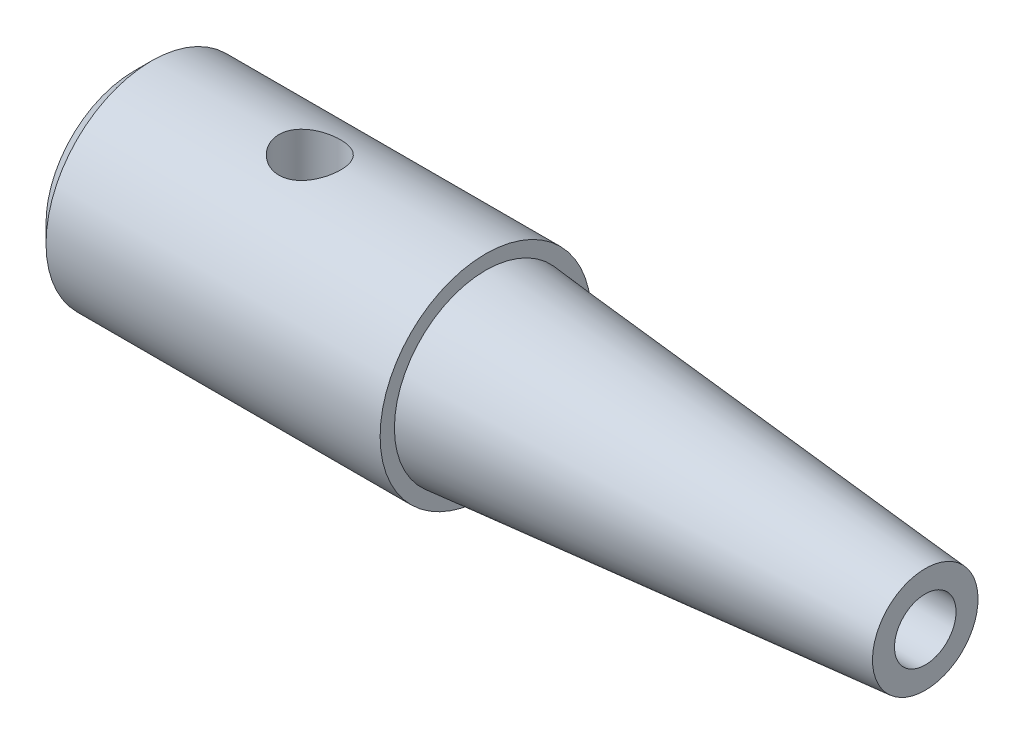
ISO-10303-21;
HEADER;
FILE_DESCRIPTION(('STEP AP214'),'2;1');
FILE_NAME('part.step','',(''),(''),'','','');
FILE_SCHEMA(('AUTOMOTIVE_DESIGN { 1 0 10303 214 1 1 1 1 }'));
ENDSEC;
DATA;
#1=APPLICATION_CONTEXT('core data for automotive mechanical design processes');
#2=APPLICATION_PROTOCOL_DEFINITION('international standard','automotive_design',2000,#1);
#3=PRODUCT_CONTEXT('',#1,'mechanical');
#4=PRODUCT('Part','Part','',(#3));
#5=PRODUCT_RELATED_PRODUCT_CATEGORY('part','',(#4));
#6=PRODUCT_DEFINITION_FORMATION('','',#4);
#7=PRODUCT_DEFINITION_CONTEXT('part definition',#1,'design');
#8=PRODUCT_DEFINITION('design','',#6,#7);
#9=PRODUCT_DEFINITION_SHAPE('','',#8);
#10=(LENGTH_UNIT() NAMED_UNIT(*) SI_UNIT(.MILLI.,.METRE.));
#11=(NAMED_UNIT(*) PLANE_ANGLE_UNIT() SI_UNIT($,.RADIAN.));
#12=(NAMED_UNIT(*) SI_UNIT($,.STERADIAN.) SOLID_ANGLE_UNIT());
#13=UNCERTAINTY_MEASURE_WITH_UNIT(LENGTH_MEASURE(1.E-05),#10,'distance_accuracy_value','');
#14=(GEOMETRIC_REPRESENTATION_CONTEXT(3) GLOBAL_UNCERTAINTY_ASSIGNED_CONTEXT((#13)) GLOBAL_UNIT_ASSIGNED_CONTEXT((#10,
#11,#12)) REPRESENTATION_CONTEXT('',''));
#15=CARTESIAN_POINT('',(0.,0.,0.));
#16=DIRECTION('',(0.,0.,1.));
#17=DIRECTION('',(1.,0.,0.));
#18=AXIS2_PLACEMENT_3D('',#15,#16,#17);
#19=CARTESIAN_POINT('',(0.,0.,0.));
#20=DIRECTION('',(1.,0.,0.));
#21=DIRECTION('',(0.,1.,0.));
#22=AXIS2_PLACEMENT_3D('',#19,#20,#21);
#23=PLANE('',#22);
#24=CARTESIAN_POINT('',(0.,0.,0.));
#25=DIRECTION('',(1.,0.,0.));
#26=DIRECTION('',(0.,1.,0.));
#27=AXIS2_PLACEMENT_3D('',#24,#25,#26);
#28=CIRCLE('',#27,5.);
#29=CARTESIAN_POINT('',(0.,5.,0.));
#30=VERTEX_POINT('',#29);
#31=EDGE_CURVE('E38',#30,#30,#28,.F.);
#32=ORIENTED_EDGE('',*,*,#31,.T.);
#33=EDGE_LOOP('',(#32));
#34=FACE_BOUND('',#33,.T.);
#35=ADVANCED_FACE('F32',(#34),#23,.F.);
#36=CARTESIAN_POINT('',(0.,0.,0.));
#37=DIRECTION('',(-1.,0.,0.));
#38=DIRECTION('',(0.,-1.,0.));
#39=AXIS2_PLACEMENT_3D('',#36,#37,#38);
#40=CYLINDRICAL_SURFACE('',#39,6.);
#41=CARTESIAN_POINT('',(1.00000000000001,0.,0.));
#42=DIRECTION('',(1.,0.,0.));
#43=DIRECTION('',(0.,1.,0.));
#44=AXIS2_PLACEMENT_3D('',#41,#42,#43);
#45=CIRCLE('',#44,6.);
#46=CARTESIAN_POINT('',(1.00000000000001,6.,0.));
#47=VERTEX_POINT('',#46);
#48=EDGE_CURVE('E11',#47,#47,#45,.T.);
#49=ORIENTED_EDGE('',*,*,#48,.T.);
#50=EDGE_LOOP('',(#49));
#51=FACE_BOUND('',#50,.T.);
#52=CARTESIAN_POINT('',(11.75,-6.,0.));
#53=CARTESIAN_POINT('',(11.749998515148,-5.99999897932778,-0.0961253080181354));
#54=CARTESIAN_POINT('',(11.7420535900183,-5.99766772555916,-0.192265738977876));
#55=CARTESIAN_POINT('',(11.7105542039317,-5.9885952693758,-0.381754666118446));
#56=CARTESIAN_POINT('',(11.6869943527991,-5.98185254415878,-0.475102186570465));
#57=CARTESIAN_POINT('',(11.6251129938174,-5.96469737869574,-0.656244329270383));
#58=CARTESIAN_POINT('',(11.5868125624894,-5.95429017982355,-0.744046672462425));
#59=CARTESIAN_POINT('',(11.4966215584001,-5.93089244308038,-0.911982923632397));
#60=CARTESIAN_POINT('',(11.4447294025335,-5.91790160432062,-0.992115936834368));
#61=CARTESIAN_POINT('',(11.327334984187,-5.89033024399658,-1.14462561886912));
#62=CARTESIAN_POINT('',(11.2615296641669,-5.87571850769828,-1.21676335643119));
#63=CARTESIAN_POINT('',(11.1188232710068,-5.84674198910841,-1.34915166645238));
#64=CARTESIAN_POINT('',(11.0419204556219,-5.83237724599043,-1.40940036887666));
#65=CARTESIAN_POINT('',(10.8772103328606,-5.80519383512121,-1.51753336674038));
#66=CARTESIAN_POINT('',(10.7892074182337,-5.79241411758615,-1.56513041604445));
#67=CARTESIAN_POINT('',(10.6060139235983,-5.7703123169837,-1.64475391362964));
#68=CARTESIAN_POINT('',(10.5108249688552,-5.76098945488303,-1.67678387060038));
#69=CARTESIAN_POINT('',(10.3186353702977,-5.74718144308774,-1.72351063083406));
#70=CARTESIAN_POINT('',(10.2217503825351,-5.74257413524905,-1.73864609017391));
#71=CARTESIAN_POINT('',(10.0267152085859,-5.73835505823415,-1.75252346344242));
#72=CARTESIAN_POINT('',(9.92856531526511,-5.73874215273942,-1.75126910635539));
#73=CARTESIAN_POINT('',(9.73731524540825,-5.74435959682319,-1.73274795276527));
#74=CARTESIAN_POINT('',(9.64415670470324,-5.74942523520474,-1.71602568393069));
#75=CARTESIAN_POINT('',(9.46202918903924,-5.76356324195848,-1.66792117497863));
#76=CARTESIAN_POINT('',(9.37306060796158,-5.77263598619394,-1.63653755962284));
#77=CARTESIAN_POINT('',(9.20048400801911,-5.79390080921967,-1.55958925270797));
#78=CARTESIAN_POINT('',(9.116961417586,-5.80613217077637,-1.51384428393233));
#79=CARTESIAN_POINT('',(8.95859323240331,-5.83231660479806,-1.40959719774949));
#80=CARTESIAN_POINT('',(8.8837496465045,-5.84627007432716,-1.35109213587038));
#81=CARTESIAN_POINT('',(8.74176939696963,-5.87499914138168,-1.22026040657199));
#82=CARTESIAN_POINT('',(8.67505196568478,-5.88978548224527,-1.14748039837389));
#83=CARTESIAN_POINT('',(8.55467457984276,-5.91802612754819,-0.9915813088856));
#84=CARTESIAN_POINT('',(8.50101535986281,-5.93148035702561,-0.908461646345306));
#85=CARTESIAN_POINT('',(8.40804165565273,-5.955652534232,-0.733510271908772));
#86=CARTESIAN_POINT('',(8.36881569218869,-5.96635347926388,-0.641629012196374));
#87=CARTESIAN_POINT('',(8.30649482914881,-5.98369087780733,-0.452189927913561));
#88=CARTESIAN_POINT('',(8.28339568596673,-5.99032840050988,-0.354633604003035));
#89=CARTESIAN_POINT('',(8.25467172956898,-5.99862388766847,-0.16018119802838));
#90=CARTESIAN_POINT('',(8.24847829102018,-6.00044382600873,-0.0633758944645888));
#91=CARTESIAN_POINT('',(8.25215387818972,-5.99937180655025,0.129894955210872));
#92=CARTESIAN_POINT('',(8.26202088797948,-5.99648044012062,0.226360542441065));
#93=CARTESIAN_POINT('',(8.29707558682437,-5.98641640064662,0.414097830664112));
#94=CARTESIAN_POINT('',(8.32193493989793,-5.97933553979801,0.505436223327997));
#95=CARTESIAN_POINT('',(8.38587721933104,-5.96170716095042,0.682629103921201));
#96=CARTESIAN_POINT('',(8.42496181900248,-5.95115923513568,0.768482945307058));
#97=CARTESIAN_POINT('',(8.51722533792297,-5.92740206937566,0.934392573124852));
#98=CARTESIAN_POINT('',(8.57069881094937,-5.91413878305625,1.01427661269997));
#99=CARTESIAN_POINT('',(8.68986114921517,-5.8864769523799,1.16413296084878));
#100=CARTESIAN_POINT('',(8.75555291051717,-5.87207813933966,1.23410291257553));
#101=CARTESIAN_POINT('',(8.89995535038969,-5.84315282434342,1.36462158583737));
#102=CARTESIAN_POINT('',(8.97903434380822,-5.82863878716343,1.424766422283));
#103=CARTESIAN_POINT('',(9.14647697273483,-5.80165389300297,1.5309555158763));
#104=CARTESIAN_POINT('',(9.23484031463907,-5.78918297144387,1.57700021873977));
#105=CARTESIAN_POINT('',(9.41800906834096,-5.76784149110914,1.65335355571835));
#106=CARTESIAN_POINT('',(9.51277902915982,-5.75895275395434,1.68374186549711));
#107=CARTESIAN_POINT('',(9.70639550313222,-5.74581531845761,1.72804822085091));
#108=CARTESIAN_POINT('',(9.80524070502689,-5.7415651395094,1.74197152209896));
#109=CARTESIAN_POINT('',(10.0000225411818,-5.73832630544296,1.75260895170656));
#110=CARTESIAN_POINT('',(10.0959205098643,-5.73913712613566,1.74997891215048));
#111=CARTESIAN_POINT('',(10.285842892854,-5.74545008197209,1.72913831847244));
#112=CARTESIAN_POINT('',(10.3798673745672,-5.75095204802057,1.7109283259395));
#113=CARTESIAN_POINT('',(10.5623661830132,-5.76589662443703,1.65985748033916));
#114=CARTESIAN_POINT('',(10.6508904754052,-5.77529488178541,1.62716125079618));
#115=CARTESIAN_POINT('',(10.8212672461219,-5.79696714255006,1.54817363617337));
#116=CARTESIAN_POINT('',(10.9031184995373,-5.80924167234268,1.50187976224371));
#117=CARTESIAN_POINT('',(11.0608920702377,-5.83581435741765,1.39513128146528));
#118=CARTESIAN_POINT('',(11.1365107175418,-5.85016789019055,1.33424162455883));
#119=CARTESIAN_POINT('',(11.276669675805,-5.87900256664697,1.20082452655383));
#120=CARTESIAN_POINT('',(11.3412071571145,-5.89348374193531,1.12829412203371));
#121=CARTESIAN_POINT('',(11.4591095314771,-5.92141239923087,0.971285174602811));
#122=CARTESIAN_POINT('',(11.51212417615,-5.93482122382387,0.886536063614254));
#123=CARTESIAN_POINT('',(11.6030752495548,-5.95864200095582,0.708936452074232));
#124=CARTESIAN_POINT('',(11.6410194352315,-5.96905549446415,0.616090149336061));
#125=CARTESIAN_POINT('',(11.6969409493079,-5.98468728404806,0.436605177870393));
#126=CARTESIAN_POINT('',(11.7167862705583,-5.99038360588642,0.35058619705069));
#127=CARTESIAN_POINT('',(11.7433155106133,-5.99804015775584,0.176382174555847));
#128=CARTESIAN_POINT('',(11.7500013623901,-6.00000093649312,0.0881974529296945));
#129=CARTESIAN_POINT('',(11.75,-6.,0.));
#130=B_SPLINE_CURVE_WITH_KNOTS('',3,(#52,#53,#54,#55,#56,#57,#58,#59,#60,#61,#62,#63,#64,#65,
#66,#67,#68,#69,#70,#71,#72,#73,#74,#75,#76,#77,#78,#79,#80,#81,#82,#83,#84,#85,#86,#87,#88,#89,
#90,#91,#92,#93,#94,#95,#96,#97,#98,#99,#100,#101,#102,#103,#104,#105,#106,#107,#108,#109,#110,
#111,#112,#113,#114,#115,#116,#117,#118,#119,#120,#121,#122,#123,#124,#125,#126,#127,#128,#129),
.UNSPECIFIED.,.T.,.F.,(4,2,2,2,2,2,2,2,2,2,2,2,2,2,2,2,2,2,2,2,2,2,2,2,2,2,2,2,2,2,2,2,2,2,2,2,
2,2,4),(0.,0.288052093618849,0.576203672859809,0.863944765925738,1.15171938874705,
1.4465642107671,1.74145537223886,2.04255951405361,2.34359575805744,2.63661948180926,
2.92957653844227,3.21259753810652,3.49564509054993,3.78239825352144,4.06921765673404,
4.36732499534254,4.6654490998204,4.96537230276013,5.26521655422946,5.55484346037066,
5.84443401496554,6.12790175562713,6.41140285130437,6.70121883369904,6.99110359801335,
7.29089914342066,7.59068521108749,7.88893020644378,8.18707997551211,8.4734936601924,
8.75989702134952,9.04312596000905,9.32640677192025,9.61950228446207,9.9126725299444,
10.2137891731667,10.5147506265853,10.7790846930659,11.0433799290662),.UNSPECIFIED.);
#131=CARTESIAN_POINT('',(11.75,-6.,0.));
#132=VERTEX_POINT('',#131);
#133=EDGE_CURVE('E74',#132,#132,#130,.T.);
#134=ORIENTED_EDGE('',*,*,#133,.T.);
#135=EDGE_LOOP('',(#134));
#136=FACE_BOUND('',#135,.T.);
#137=CARTESIAN_POINT('',(10.,5.7391201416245,1.75));
#138=CARTESIAN_POINT('',(9.90397284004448,5.73912135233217,1.74999848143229));
#139=CARTESIAN_POINT('',(9.80793050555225,5.74155660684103,1.74206920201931));
#140=CARTESIAN_POINT('',(9.61864484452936,5.75099819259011,1.71063758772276));
#141=CARTESIAN_POINT('',(9.52540258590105,5.75800624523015,1.687129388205));
#142=CARTESIAN_POINT('',(9.3444840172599,5.77573366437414,1.62539891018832));
#143=CARTESIAN_POINT('',(9.25679908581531,5.78644710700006,1.58720010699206));
#144=CARTESIAN_POINT('',(9.08906262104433,5.8103702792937,1.49724903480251));
#145=CARTESIAN_POINT('',(9.00901209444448,5.82358033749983,1.44549498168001));
#146=CARTESIAN_POINT('',(8.85642235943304,5.8514513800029,1.32824554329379));
#147=CARTESIAN_POINT('',(8.78414529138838,5.8661419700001,1.26241596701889));
#148=CARTESIAN_POINT('',(8.65148437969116,5.89506524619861,1.11960099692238));
#149=CARTESIAN_POINT('',(8.59110198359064,5.90929787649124,1.04261424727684));
#150=CARTESIAN_POINT('',(8.48281795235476,5.93603636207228,0.877817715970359));
#151=CARTESIAN_POINT('',(8.43518186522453,5.94850325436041,0.789826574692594));
#152=CARTESIAN_POINT('',(8.35548308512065,5.96996273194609,0.606657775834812));
#153=CARTESIAN_POINT('',(8.32341722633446,5.97895602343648,0.511481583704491));
#154=CARTESIAN_POINT('',(8.27663165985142,5.99224555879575,0.319385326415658));
#155=CARTESIAN_POINT('',(8.26146489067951,5.9966626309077,0.222582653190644));
#156=CARTESIAN_POINT('',(8.24749626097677,6.0007267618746,0.0277126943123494));
#157=CARTESIAN_POINT('',(8.24869114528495,6.00037476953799,-0.0703543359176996));
#158=CARTESIAN_POINT('',(8.2671079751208,5.99502665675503,-0.261839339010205));
#159=CARTESIAN_POINT('',(8.28384609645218,5.99017073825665,-0.3553083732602));
#160=CARTESIAN_POINT('',(8.33208620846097,5.97652948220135,-0.538048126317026));
#161=CARTESIAN_POINT('',(8.36358911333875,5.96774390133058,-0.627318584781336));
#162=CARTESIAN_POINT('',(8.44080317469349,5.94703299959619,-0.800299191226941));
#163=CARTESIAN_POINT('',(8.48666998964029,5.93507351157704,-0.883935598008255));
#164=CARTESIAN_POINT('',(8.59118777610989,5.9092886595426,-1.04248200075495));
#165=CARTESIAN_POINT('',(8.64984164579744,5.89546287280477,-1.11739001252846));
#166=CARTESIAN_POINT('',(8.78079366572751,5.86683410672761,-1.25924141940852));
#167=CARTESIAN_POINT('',(8.85351185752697,5.85201387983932,-1.32579407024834));
#168=CARTESIAN_POINT('',(9.00922420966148,5.82351168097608,-1.44586660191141));
#169=CARTESIAN_POINT('',(9.09221927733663,5.8098298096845,-1.49938533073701));
#170=CARTESIAN_POINT('',(9.26711038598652,5.78507419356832,-1.59224878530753));
#171=CARTESIAN_POINT('',(9.35907703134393,5.77402396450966,-1.63146726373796));
#172=CARTESIAN_POINT('',(9.54870501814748,5.75606450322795,-1.69374851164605));
#173=CARTESIAN_POINT('',(9.64636461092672,5.74915400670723,-1.71681621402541));
#174=CARTESIAN_POINT('',(9.84090391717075,5.74053185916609,-1.7454256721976));
#175=CARTESIAN_POINT('',(9.93768901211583,5.73864494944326,-1.75155853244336));
#176=CARTESIAN_POINT('',(10.1309062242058,5.73980029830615,-1.74776921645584));
#177=CARTESIAN_POINT('',(10.227338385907,5.74284191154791,-1.73784914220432));
#178=CARTESIAN_POINT('',(10.4146968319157,5.75334026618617,-1.70276068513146));
#179=CARTESIAN_POINT('',(10.5056998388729,5.76068862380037,-1.67796628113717));
#180=CARTESIAN_POINT('',(10.6822501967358,5.77886185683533,-1.61426316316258));
#181=CARTESIAN_POINT('',(10.7677967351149,5.7896872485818,-1.57535235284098));
#182=CARTESIAN_POINT('',(10.9334278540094,5.81393978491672,-1.48337952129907));
#183=CARTESIAN_POINT('',(11.0133163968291,5.82742647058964,-1.42998054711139));
#184=CARTESIAN_POINT('',(11.1632152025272,5.85535101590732,-1.31095181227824));
#185=CARTESIAN_POINT('',(11.2332232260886,5.86978909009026,-1.24531928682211));
#186=CARTESIAN_POINT('',(11.363924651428,5.89860806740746,-1.10091901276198));
#187=CARTESIAN_POINT('',(11.4242007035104,5.91296886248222,-1.02176859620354));
#188=CARTESIAN_POINT('',(11.5306213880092,5.93949812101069,-0.854138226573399));
#189=CARTESIAN_POINT('',(11.5767667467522,5.95166669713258,-0.765658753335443));
#190=CARTESIAN_POINT('',(11.65317278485,5.97236405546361,-0.582484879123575));
#191=CARTESIAN_POINT('',(11.6835533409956,5.98092021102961,-0.487843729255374));
#192=CARTESIAN_POINT('',(11.7278873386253,5.99354961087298,-0.294506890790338));
#193=CARTESIAN_POINT('',(11.7418451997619,5.99762406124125,-0.195812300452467));
#194=CARTESIAN_POINT('',(11.7526165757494,6.00076178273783,-0.00103743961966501));
#195=CARTESIAN_POINT('',(11.7500370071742,6.00000245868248,0.0950068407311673));
#196=CARTESIAN_POINT('',(11.7292467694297,5.99397167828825,0.285235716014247));
#197=CARTESIAN_POINT('',(11.7110369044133,5.98870045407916,0.379420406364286));
#198=CARTESIAN_POINT('',(11.6598708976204,5.97428492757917,0.562376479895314));
#199=CARTESIAN_POINT('',(11.6270589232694,5.96517853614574,0.651191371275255));
#200=CARTESIAN_POINT('',(11.5477485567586,5.94403648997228,0.822103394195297));
#201=CARTESIAN_POINT('',(11.5012479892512,5.93200036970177,0.904199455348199));
#202=CARTESIAN_POINT('',(11.3942234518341,5.90580993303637,1.06207963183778));
#203=CARTESIAN_POINT('',(11.3333129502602,5.89160195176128,1.13759275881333));
#204=CARTESIAN_POINT('',(11.1999031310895,5.86285183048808,1.27752965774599));
#205=CARTESIAN_POINT('',(11.1274005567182,5.84830959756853,1.34195030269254));
#206=CARTESIAN_POINT('',(10.9704520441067,5.82006568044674,1.45966022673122));
#207=CARTESIAN_POINT('',(10.8857308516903,5.80639844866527,1.51259163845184));
#208=CARTESIAN_POINT('',(10.7082058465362,5.78198514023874,1.60339388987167));
#209=CARTESIAN_POINT('',(10.615406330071,5.77123752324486,1.64127267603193));
#210=CARTESIAN_POINT('',(10.4360728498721,5.75505738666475,1.69707126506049));
#211=CARTESIAN_POINT('',(10.3501630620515,5.74913519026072,1.71686706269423));
#212=CARTESIAN_POINT('',(10.1761728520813,5.74116635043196,1.74333098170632));
#213=CARTESIAN_POINT('',(10.0880928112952,5.73911903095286,1.7500013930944));
#214=CARTESIAN_POINT('',(10.,5.7391201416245,1.75));
#215=B_SPLINE_CURVE_WITH_KNOTS('',3,(#137,#138,#139,#140,#141,#142,#143,#144,#145,#146,#147,
#148,#149,#150,#151,#152,#153,#154,#155,#156,#157,#158,#159,#160,#161,#162,#163,#164,#165,#166,
#167,#168,#169,#170,#171,#172,#173,#174,#175,#176,#177,#178,#179,#180,#181,#182,#183,#184,#185,
#186,#187,#188,#189,#190,#191,#192,#193,#194,#195,#196,#197,#198,#199,#200,#201,#202,#203,#204,
#205,#206,#207,#208,#209,#210,#211,#212,#213,#214),.UNSPECIFIED.,.T.,.F.,(4,2,2,2,2,2,2,2,2,2,2,
2,2,2,2,2,2,2,2,2,2,2,2,2,2,2,2,2,2,2,2,2,2,2,2,2,2,2,4),(0.,0.287756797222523,
0.575621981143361,0.863029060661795,1.15047398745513,1.44570366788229,1.74096925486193,
2.04197684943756,2.3429232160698,2.63570371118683,2.92842595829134,3.21233131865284,
3.49625426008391,3.78336718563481,4.07054525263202,4.36821044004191,4.66590192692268,
4.96616130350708,5.26632893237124,5.55587830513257,5.84538976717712,6.12791051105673,
6.41047322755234,6.70027379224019,6.99013993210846,7.29026491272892,7.5903744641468,
7.88816722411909,8.1858798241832,8.47273065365,8.75956672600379,9.04363159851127,
9.32774163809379,9.62056977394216,9.91348032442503,10.2145064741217,10.5153734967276,
10.7794001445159,11.0433807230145),.UNSPECIFIED.);
#216=CARTESIAN_POINT('',(10.,5.7391201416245,1.75));
#217=VERTEX_POINT('',#216);
#218=EDGE_CURVE('E80',#217,#217,#215,.T.);
#219=ORIENTED_EDGE('',*,*,#218,.T.);
#220=EDGE_LOOP('',(#219));
#221=FACE_BOUND('',#220,.T.);
#222=CARTESIAN_POINT('',(20.,0.,0.));
#223=DIRECTION('',(-1.,0.,0.));
#224=DIRECTION('',(0.,-1.,0.));
#225=AXIS2_PLACEMENT_3D('',#222,#223,#224);
#226=CIRCLE('',#225,6.);
#227=CARTESIAN_POINT('',(20.,-6.,0.));
#228=VERTEX_POINT('',#227);
#229=EDGE_CURVE('E69',#228,#228,#226,.T.);
#230=ORIENTED_EDGE('',*,*,#229,.T.);
#231=EDGE_LOOP('',(#230));
#232=FACE_BOUND('',#231,.T.);
#233=ADVANCED_FACE('F59',(#51,#136,#221,#232),#40,.T.);
#234=CARTESIAN_POINT('',(20.,6.,0.));
#235=DIRECTION('',(-1.,0.,0.));
#236=DIRECTION('',(0.,-1.,0.));
#237=AXIS2_PLACEMENT_3D('',#234,#235,#236);
#238=PLANE('',#237);
#239=ORIENTED_EDGE('',*,*,#229,.F.);
#240=EDGE_LOOP('',(#239));
#241=FACE_BOUND('',#240,.T.);
#242=CARTESIAN_POINT('',(20.,0.,0.));
#243=DIRECTION('',(-1.,0.,0.));
#244=DIRECTION('',(0.,-1.,0.));
#245=AXIS2_PLACEMENT_3D('',#242,#243,#244);
#246=CIRCLE('',#245,5.18721658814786);
#247=CARTESIAN_POINT('',(20.,-5.18721658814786,0.));
#248=VERTEX_POINT('',#247);
#249=EDGE_CURVE('E71',#248,#248,#246,.T.);
#250=ORIENTED_EDGE('',*,*,#249,.T.);
#251=EDGE_LOOP('',(#250));
#252=FACE_BOUND('',#251,.T.);
#253=ADVANCED_FACE('F64',(#241,#252),#238,.F.);
#254=CARTESIAN_POINT('',(45.,0.,0.));
#255=DIRECTION('',(-1.,0.,0.));
#256=DIRECTION('',(0.,-1.,0.));
#257=AXIS2_PLACEMENT_3D('',#254,#255,#256);
#258=CONICAL_SURFACE('',#257,3.,0.0872664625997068);
#259=ORIENTED_EDGE('',*,*,#249,.F.);
#260=EDGE_LOOP('',(#259));
#261=FACE_BOUND('',#260,.T.);
#262=CARTESIAN_POINT('',(45.,0.,0.));
#263=DIRECTION('',(-1.,0.,0.));
#264=DIRECTION('',(0.,-1.,0.));
#265=AXIS2_PLACEMENT_3D('',#262,#263,#264);
#266=CIRCLE('',#265,3.);
#267=CARTESIAN_POINT('',(45.,-3.,0.));
#268=VERTEX_POINT('',#267);
#269=EDGE_CURVE('E107',#268,#268,#266,.T.);
#270=ORIENTED_EDGE('',*,*,#269,.T.);
#271=EDGE_LOOP('',(#270));
#272=FACE_BOUND('',#271,.T.);
#273=ADVANCED_FACE('F103',(#261,#272),#258,.T.);
#274=CARTESIAN_POINT('',(45.,1.75,0.));
#275=DIRECTION('',(-1.,0.,0.));
#276=DIRECTION('',(0.,-1.,0.));
#277=AXIS2_PLACEMENT_3D('',#274,#275,#276);
#278=PLANE('',#277);
#279=ORIENTED_EDGE('',*,*,#269,.F.);
#280=EDGE_LOOP('',(#279));
#281=FACE_BOUND('',#280,.T.);
#282=CARTESIAN_POINT('',(45.,0.,0.));
#283=DIRECTION('',(-1.,0.,0.));
#284=DIRECTION('',(0.,-1.,0.));
#285=AXIS2_PLACEMENT_3D('',#282,#283,#284);
#286=CIRCLE('',#285,1.75);
#287=CARTESIAN_POINT('',(45.,-1.75,0.));
#288=VERTEX_POINT('',#287);
#289=EDGE_CURVE('E110',#288,#288,#286,.T.);
#290=ORIENTED_EDGE('',*,*,#289,.T.);
#291=EDGE_LOOP('',(#290));
#292=FACE_BOUND('',#291,.T.);
#293=ADVANCED_FACE('F54',(#281,#292),#278,.F.);
#294=CARTESIAN_POINT('',(0.,0.,0.));
#295=DIRECTION('',(-1.,0.,0.));
#296=DIRECTION('',(0.,-1.,0.));
#297=AXIS2_PLACEMENT_3D('',#294,#295,#296);
#298=CYLINDRICAL_SURFACE('',#297,1.75);
#299=ORIENTED_EDGE('',*,*,#289,.F.);
#300=EDGE_LOOP('',(#299));
#301=FACE_BOUND('',#300,.T.);
#302=CARTESIAN_POINT('',(25.,0.,0.));
#303=DIRECTION('',(-1.,0.,0.));
#304=DIRECTION('',(0.,-1.,0.));
#305=AXIS2_PLACEMENT_3D('',#302,#303,#304);
#306=CIRCLE('',#305,1.75);
#307=CARTESIAN_POINT('',(25.,-1.75,0.));
#308=VERTEX_POINT('',#307);
#309=EDGE_CURVE('E79',#308,#308,#306,.T.);
#310=ORIENTED_EDGE('',*,*,#309,.T.);
#311=EDGE_LOOP('',(#310));
#312=FACE_BOUND('',#311,.T.);
#313=ADVANCED_FACE('F44',(#301,#312),#298,.F.);
#314=CARTESIAN_POINT('',(23.9896370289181,0.,0.));
#315=DIRECTION('',(1.,0.,0.));
#316=DIRECTION('',(0.,1.,0.));
#317=AXIS2_PLACEMENT_3D('',#314,#315,#316);
#318=CONICAL_SURFACE('',#317,0.,1.04719755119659);
#319=ORIENTED_EDGE('',*,*,#309,.F.);
#320=EDGE_LOOP('',(#319));
#321=FACE_BOUND('',#320,.T.);
#322=CARTESIAN_POINT('',(23.9896370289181,0.,0.));
#323=VERTEX_POINT('',#322);
#324=VERTEX_LOOP('',#323);
#325=FACE_BOUND('',#324,.T.);
#326=ADVANCED_FACE('F41',(#321,#325),#318,.F.);
#327=CARTESIAN_POINT('',(10.,-10.,0.));
#328=DIRECTION('',(0.,1.,0.));
#329=DIRECTION('',(0.,0.,1.));
#330=AXIS2_PLACEMENT_3D('',#327,#328,#329);
#331=CYLINDRICAL_SURFACE('',#330,1.75);
#332=ORIENTED_EDGE('',*,*,#218,.F.);
#333=EDGE_LOOP('',(#332));
#334=FACE_BOUND('',#333,.T.);
#335=ORIENTED_EDGE('',*,*,#133,.F.);
#336=EDGE_LOOP('',(#335));
#337=FACE_BOUND('',#336,.T.);
#338=ADVANCED_FACE('F43',(#334,#337),#331,.F.);
#339=CARTESIAN_POINT('',(0.,0.,0.));
#340=DIRECTION('',(1.,0.,0.));
#341=DIRECTION('',(0.,1.,0.));
#342=AXIS2_PLACEMENT_3D('',#339,#340,#341);
#343=CONICAL_SURFACE('',#342,5.,0.785398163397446);
#344=ORIENTED_EDGE('',*,*,#48,.F.);
#345=EDGE_LOOP('',(#344));
#346=FACE_BOUND('',#345,.T.);
#347=ORIENTED_EDGE('',*,*,#31,.F.);
#348=EDGE_LOOP('',(#347));
#349=FACE_BOUND('',#348,.T.);
#350=ADVANCED_FACE('F51',(#346,#349),#343,.T.);
#351=CLOSED_SHELL('',(#35,#233,#253,#273,#293,#313,#326,#338,#350));
#352=MANIFOLD_SOLID_BREP('B2',#351);
#353=ADVANCED_BREP_SHAPE_REPRESENTATION('',(#18,#352),#14);
#354=SHAPE_DEFINITION_REPRESENTATION(#9,#353);
ENDSEC;
END-ISO-10303-21;
